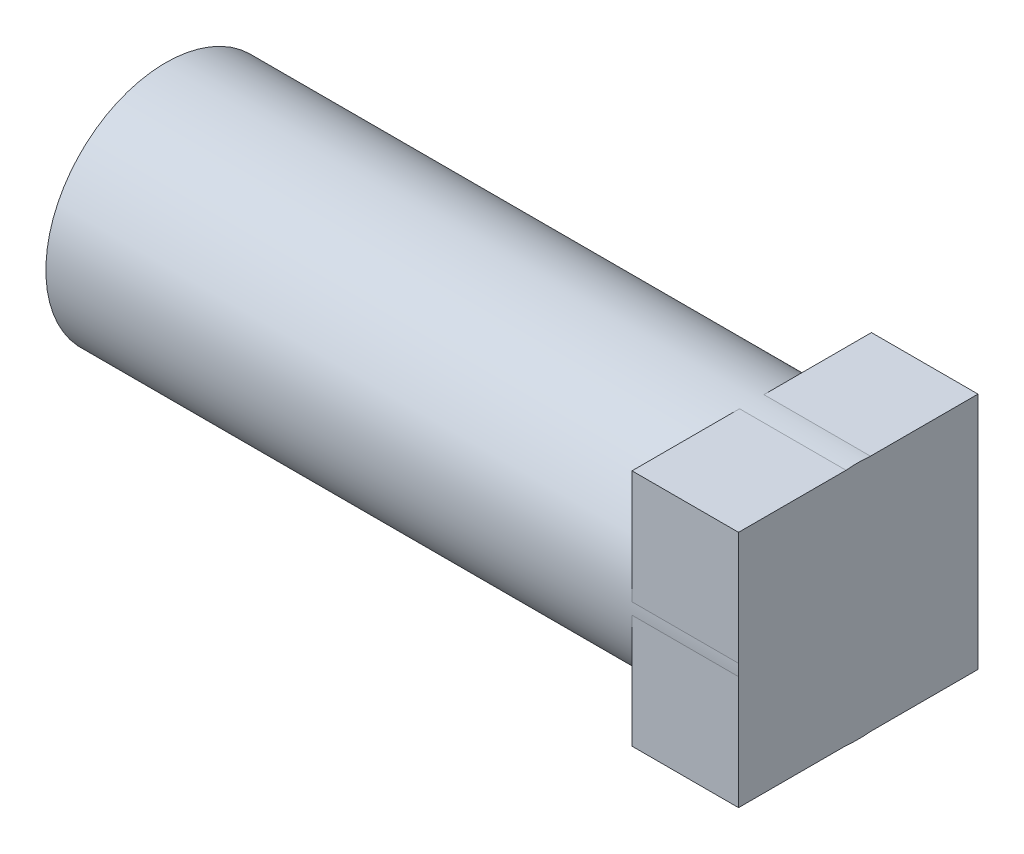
ISO-10303-21;
HEADER;
FILE_DESCRIPTION(('STEP AP214'),'2;1');
FILE_NAME('part.step','',(''),(''),'','','');
FILE_SCHEMA(('AUTOMOTIVE_DESIGN { 1 0 10303 214 1 1 1 1 }'));
ENDSEC;
DATA;
#1=APPLICATION_CONTEXT('core data for automotive mechanical design processes');
#2=APPLICATION_PROTOCOL_DEFINITION('international standard','automotive_design',2000,#1);
#3=PRODUCT_CONTEXT('',#1,'mechanical');
#4=PRODUCT('Part','Part','',(#3));
#5=PRODUCT_RELATED_PRODUCT_CATEGORY('part','',(#4));
#6=PRODUCT_DEFINITION_FORMATION('','',#4);
#7=PRODUCT_DEFINITION_CONTEXT('part definition',#1,'design');
#8=PRODUCT_DEFINITION('design','',#6,#7);
#9=PRODUCT_DEFINITION_SHAPE('','',#8);
#10=(LENGTH_UNIT() NAMED_UNIT(*) SI_UNIT(.MILLI.,.METRE.));
#11=(NAMED_UNIT(*) PLANE_ANGLE_UNIT() SI_UNIT($,.RADIAN.));
#12=(NAMED_UNIT(*) SI_UNIT($,.STERADIAN.) SOLID_ANGLE_UNIT());
#13=UNCERTAINTY_MEASURE_WITH_UNIT(LENGTH_MEASURE(1.E-05),#10,'distance_accuracy_value','');
#14=(GEOMETRIC_REPRESENTATION_CONTEXT(3) GLOBAL_UNCERTAINTY_ASSIGNED_CONTEXT((#13)) GLOBAL_UNIT_ASSIGNED_CONTEXT((#10,
#11,#12)) REPRESENTATION_CONTEXT('',''));
#15=CARTESIAN_POINT('',(0.,0.,0.));
#16=DIRECTION('',(0.,0.,1.));
#17=DIRECTION('',(1.,0.,0.));
#18=AXIS2_PLACEMENT_3D('',#15,#16,#17);
#19=CARTESIAN_POINT('',(13.,0.,0.));
#20=DIRECTION('',(-1.,0.,0.));
#21=DIRECTION('',(0.,0.,1.));
#22=AXIS2_PLACEMENT_3D('',#19,#20,#21);
#23=CYLINDRICAL_SURFACE('',#22,2.25);
#24=CARTESIAN_POINT('',(13.,0.,0.));
#25=DIRECTION('',(1.,0.,0.));
#26=DIRECTION('',(0.,0.,-1.));
#27=AXIS2_PLACEMENT_3D('',#24,#25,#26);
#28=CIRCLE('',#27,2.25);
#29=CARTESIAN_POINT('',(13.,2.2382876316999,-0.229278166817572));
#30=VERTEX_POINT('',#29);
#31=CARTESIAN_POINT('',(13.,2.2382876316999,0.229278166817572));
#32=VERTEX_POINT('',#31);
#33=EDGE_CURVE('E172',#30,#32,#28,.T.);
#34=ORIENTED_EDGE('',*,*,#33,.F.);
#35=DIRECTION('',(-1.,0.,0.));
#36=VECTOR('',#35,1.);
#37=CARTESIAN_POINT('',(13.,2.2382876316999,-0.229278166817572));
#38=LINE('',#37,#36);
#39=CARTESIAN_POINT('',(11.,2.2382876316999,-0.229278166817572));
#40=VERTEX_POINT('',#39);
#41=EDGE_CURVE('E224',#30,#40,#38,.T.);
#42=ORIENTED_EDGE('',*,*,#41,.T.);
#43=CARTESIAN_POINT('',(11.,0.,0.));
#44=DIRECTION('',(1.,0.,0.));
#45=DIRECTION('',(0.,0.,-1.));
#46=AXIS2_PLACEMENT_3D('',#43,#44,#45);
#47=CIRCLE('',#46,2.25);
#48=CARTESIAN_POINT('',(11.,0.108468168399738,-2.2473839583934));
#49=VERTEX_POINT('',#48);
#50=EDGE_CURVE('E11',#49,#40,#47,.T.);
#51=ORIENTED_EDGE('',*,*,#50,.F.);
#52=DIRECTION('',(-1.,0.,0.));
#53=VECTOR('',#52,1.);
#54=CARTESIAN_POINT('',(13.,0.108468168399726,-2.2473839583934));
#55=LINE('',#54,#53);
#56=CARTESIAN_POINT('',(13.,0.108468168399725,-2.2473839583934));
#57=VERTEX_POINT('',#56);
#58=EDGE_CURVE('E232',#49,#57,#55,.F.);
#59=ORIENTED_EDGE('',*,*,#58,.T.);
#60=CARTESIAN_POINT('',(13.,-0.108468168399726,-2.2473839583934));
#61=DIRECTION('',(0.,1.,0.));
#62=VECTOR('',#61,1.);
#63=LINE('',#60,#62);
#64=CARTESIAN_POINT('',(13.,-0.108468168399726,-2.2473839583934));
#65=VERTEX_POINT('',#64);
#66=EDGE_CURVE('E180',#65,#57,#63,.T.);
#67=ORIENTED_EDGE('',*,*,#66,.F.);
#68=DIRECTION('',(-1.,0.,0.));
#69=VECTOR('',#68,1.);
#70=CARTESIAN_POINT('',(13.,-0.108468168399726,-2.2473839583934));
#71=LINE('',#70,#69);
#72=CARTESIAN_POINT('',(11.,-0.108468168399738,-2.2473839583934));
#73=VERTEX_POINT('',#72);
#74=EDGE_CURVE('E228',#65,#73,#71,.T.);
#75=ORIENTED_EDGE('',*,*,#74,.T.);
#76=CARTESIAN_POINT('',(11.,-2.23828763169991,-0.229278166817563));
#77=VERTEX_POINT('',#76);
#78=EDGE_CURVE('E45',#77,#73,#47,.T.);
#79=ORIENTED_EDGE('',*,*,#78,.F.);
#80=DIRECTION('',(-1.,0.,0.));
#81=VECTOR('',#80,1.);
#82=CARTESIAN_POINT('',(13.,-2.23828763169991,-0.229278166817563));
#83=LINE('',#82,#81);
#84=CARTESIAN_POINT('',(13.,-2.23828763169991,-0.229278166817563));
#85=VERTEX_POINT('',#84);
#86=EDGE_CURVE('E250',#77,#85,#83,.F.);
#87=ORIENTED_EDGE('',*,*,#86,.T.);
#88=CARTESIAN_POINT('',(13.,-2.23828763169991,0.229278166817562));
#89=VERTEX_POINT('',#88);
#90=EDGE_CURVE('E170',#89,#85,#28,.T.);
#91=ORIENTED_EDGE('',*,*,#90,.F.);
#92=DIRECTION('',(-1.,0.,0.));
#93=VECTOR('',#92,1.);
#94=CARTESIAN_POINT('',(13.,-2.23828763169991,0.229278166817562));
#95=LINE('',#94,#93);
#96=CARTESIAN_POINT('',(11.,-2.23828763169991,0.229278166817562));
#97=VERTEX_POINT('',#96);
#98=EDGE_CURVE('E258',#89,#97,#95,.T.);
#99=ORIENTED_EDGE('',*,*,#98,.T.);
#100=CARTESIAN_POINT('',(11.,-0.108468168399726,2.2473839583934));
#101=VERTEX_POINT('',#100);
#102=EDGE_CURVE('E147',#101,#97,#47,.T.);
#103=ORIENTED_EDGE('',*,*,#102,.F.);
#104=DIRECTION('',(-1.,0.,0.));
#105=VECTOR('',#104,1.);
#106=CARTESIAN_POINT('',(13.,-0.108468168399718,2.2473839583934));
#107=LINE('',#106,#105);
#108=CARTESIAN_POINT('',(13.,-0.108468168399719,2.2473839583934));
#109=VERTEX_POINT('',#108);
#110=EDGE_CURVE('E131',#101,#109,#107,.F.);
#111=ORIENTED_EDGE('',*,*,#110,.T.);
#112=CARTESIAN_POINT('',(13.,0.108468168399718,2.2473839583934));
#113=DIRECTION('',(0.,-1.,0.));
#114=VECTOR('',#113,1.);
#115=LINE('',#112,#114);
#116=CARTESIAN_POINT('',(13.,0.108468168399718,2.2473839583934));
#117=VERTEX_POINT('',#116);
#118=EDGE_CURVE('E177',#117,#109,#115,.T.);
#119=ORIENTED_EDGE('',*,*,#118,.F.);
#120=DIRECTION('',(-1.,0.,0.));
#121=VECTOR('',#120,1.);
#122=CARTESIAN_POINT('',(13.,0.108468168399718,2.2473839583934));
#123=LINE('',#122,#121);
#124=CARTESIAN_POINT('',(11.,0.108468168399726,2.2473839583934));
#125=VERTEX_POINT('',#124);
#126=EDGE_CURVE('E175',#117,#125,#123,.T.);
#127=ORIENTED_EDGE('',*,*,#126,.T.);
#128=CARTESIAN_POINT('',(11.,2.2382876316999,0.229278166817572));
#129=VERTEX_POINT('',#128);
#130=EDGE_CURVE('E43',#129,#125,#47,.T.);
#131=ORIENTED_EDGE('',*,*,#130,.F.);
#132=DIRECTION('',(-1.,0.,0.));
#133=VECTOR('',#132,1.);
#134=CARTESIAN_POINT('',(13.,2.2382876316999,0.229278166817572));
#135=LINE('',#134,#133);
#136=EDGE_CURVE('E225',#129,#32,#135,.F.);
#137=ORIENTED_EDGE('',*,*,#136,.T.);
#138=EDGE_LOOP('',(#34,#42,#51,#59,#67,#75,#79,#87,#91,#99,#103,#111,#119,#127,#131,#137));
#139=FACE_BOUND('',#138,.T.);
#140=CARTESIAN_POINT('',(0.,0.,0.));
#141=DIRECTION('',(1.,0.,0.));
#142=DIRECTION('',(0.,0.,-1.));
#143=AXIS2_PLACEMENT_3D('',#140,#141,#142);
#144=CIRCLE('',#143,2.25);
#145=CARTESIAN_POINT('',(0.,0.,-2.25));
#146=VERTEX_POINT('',#145);
#147=EDGE_CURVE('E173',#146,#146,#144,.T.);
#148=ORIENTED_EDGE('',*,*,#147,.T.);
#149=EDGE_LOOP('',(#148));
#150=FACE_BOUND('',#149,.T.);
#151=ADVANCED_FACE('F33',(#139,#150),#23,.T.);
#152=CARTESIAN_POINT('',(13.,0.,0.));
#153=DIRECTION('',(1.,0.,0.));
#154=DIRECTION('',(0.,0.,-1.));
#155=AXIS2_PLACEMENT_3D('',#152,#153,#154);
#156=PLANE('',#155);
#157=ORIENTED_EDGE('',*,*,#90,.T.);
#158=DIRECTION('',(0.,0.,-1.));
#159=VECTOR('',#158,1.);
#160=CARTESIAN_POINT('',(13.,-2.2382876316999,-2.2473839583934));
#161=LINE('',#160,#159);
#162=CARTESIAN_POINT('',(13.,-2.2382876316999,-2.2473839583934));
#163=VERTEX_POINT('',#162);
#164=EDGE_CURVE('E396',#85,#163,#161,.T.);
#165=ORIENTED_EDGE('',*,*,#164,.T.);
#166=DIRECTION('',(0.,1.,0.));
#167=VECTOR('',#166,1.);
#168=CARTESIAN_POINT('',(13.,-2.2382876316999,-2.2473839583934));
#169=LINE('',#168,#167);
#170=EDGE_CURVE('E52',#163,#65,#169,.T.);
#171=ORIENTED_EDGE('',*,*,#170,.T.);
#172=ORIENTED_EDGE('',*,*,#66,.T.);
#173=CARTESIAN_POINT('',(13.,2.2382876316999,-2.2473839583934));
#174=VERTEX_POINT('',#173);
#175=EDGE_CURVE('E242',#57,#174,#169,.T.);
#176=ORIENTED_EDGE('',*,*,#175,.T.);
#177=DIRECTION('',(0.,0.,1.));
#178=VECTOR('',#177,1.);
#179=CARTESIAN_POINT('',(13.,2.2382876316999,-2.2473839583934));
#180=LINE('',#179,#178);
#181=EDGE_CURVE('E136',#174,#30,#180,.T.);
#182=ORIENTED_EDGE('',*,*,#181,.T.);
#183=ORIENTED_EDGE('',*,*,#33,.T.);
#184=CARTESIAN_POINT('',(13.,2.2382876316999,2.2473839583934));
#185=VERTEX_POINT('',#184);
#186=EDGE_CURVE('E217',#32,#185,#180,.T.);
#187=ORIENTED_EDGE('',*,*,#186,.T.);
#188=DIRECTION('',(0.,-1.,0.));
#189=VECTOR('',#188,1.);
#190=CARTESIAN_POINT('',(13.,-2.23828763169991,2.2473839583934));
#191=LINE('',#190,#189);
#192=EDGE_CURVE('E163',#185,#117,#191,.T.);
#193=ORIENTED_EDGE('',*,*,#192,.T.);
#194=ORIENTED_EDGE('',*,*,#118,.T.);
#195=CARTESIAN_POINT('',(13.,-2.23828763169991,2.2473839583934));
#196=VERTEX_POINT('',#195);
#197=EDGE_CURVE('E167',#109,#196,#191,.T.);
#198=ORIENTED_EDGE('',*,*,#197,.T.);
#199=EDGE_CURVE('E59',#196,#89,#161,.T.);
#200=ORIENTED_EDGE('',*,*,#199,.T.);
#201=EDGE_LOOP('',(#157,#165,#171,#172,#176,#182,#183,#187,#193,#194,#198,#200));
#202=FACE_BOUND('',#201,.T.);
#203=ADVANCED_FACE('F186',(#202),#156,.T.);
#204=CARTESIAN_POINT('',(0.,0.,0.));
#205=DIRECTION('',(1.,0.,0.));
#206=DIRECTION('',(0.,0.,-1.));
#207=AXIS2_PLACEMENT_3D('',#204,#205,#206);
#208=PLANE('',#207);
#209=ORIENTED_EDGE('',*,*,#147,.F.);
#210=EDGE_LOOP('',(#209));
#211=FACE_BOUND('',#210,.T.);
#212=ADVANCED_FACE('F195',(#211),#208,.F.);
#213=CARTESIAN_POINT('',(11.,0.,0.));
#214=DIRECTION('',(1.,0.,0.));
#215=DIRECTION('',(0.,0.,-1.));
#216=AXIS2_PLACEMENT_3D('',#213,#214,#215);
#217=PLANE('',#216);
#218=DIRECTION('',(0.,0.,-1.));
#219=VECTOR('',#218,1.);
#220=CARTESIAN_POINT('',(11.,-2.2382876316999,-2.2473839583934));
#221=LINE('',#220,#219);
#222=CARTESIAN_POINT('',(11.,-2.2382876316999,-2.2473839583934));
#223=VERTEX_POINT('',#222);
#224=EDGE_CURVE('E149',#77,#223,#221,.T.);
#225=ORIENTED_EDGE('',*,*,#224,.F.);
#226=ORIENTED_EDGE('',*,*,#78,.T.);
#227=DIRECTION('',(0.,1.,0.));
#228=VECTOR('',#227,1.);
#229=CARTESIAN_POINT('',(11.,-2.2382876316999,-2.2473839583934));
#230=LINE('',#229,#228);
#231=EDGE_CURVE('E151',#223,#73,#230,.T.);
#232=ORIENTED_EDGE('',*,*,#231,.F.);
#233=EDGE_LOOP('',(#225,#226,#232));
#234=FACE_BOUND('',#233,.T.);
#235=ADVANCED_FACE('F282',(#234),#217,.F.);
#236=CARTESIAN_POINT('',(11.,-2.2382876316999,-2.2473839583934));
#237=DIRECTION('',(0.,-1.,0.));
#238=DIRECTION('',(0.,0.,-1.));
#239=AXIS2_PLACEMENT_3D('',#236,#237,#238);
#240=PLANE('',#239);
#241=ORIENTED_EDGE('',*,*,#86,.F.);
#242=ORIENTED_EDGE('',*,*,#224,.T.);
#243=DIRECTION('',(1.,0.,0.));
#244=VECTOR('',#243,1.);
#245=CARTESIAN_POINT('',(11.,-2.2382876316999,-2.2473839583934));
#246=LINE('',#245,#244);
#247=EDGE_CURVE('E143',#223,#163,#246,.T.);
#248=ORIENTED_EDGE('',*,*,#247,.T.);
#249=ORIENTED_EDGE('',*,*,#164,.F.);
#250=EDGE_LOOP('',(#241,#242,#248,#249));
#251=FACE_BOUND('',#250,.T.);
#252=ADVANCED_FACE('F303',(#251),#240,.T.);
#253=CARTESIAN_POINT('',(11.,-2.2382876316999,-2.2473839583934));
#254=DIRECTION('',(0.,0.,-1.));
#255=DIRECTION('',(-1.,0.,0.));
#256=AXIS2_PLACEMENT_3D('',#253,#254,#255);
#257=PLANE('',#256);
#258=ORIENTED_EDGE('',*,*,#74,.F.);
#259=ORIENTED_EDGE('',*,*,#170,.F.);
#260=ORIENTED_EDGE('',*,*,#247,.F.);
#261=ORIENTED_EDGE('',*,*,#231,.T.);
#262=EDGE_LOOP('',(#258,#259,#260,#261));
#263=FACE_BOUND('',#262,.T.);
#264=ADVANCED_FACE('F279',(#263),#257,.T.);
#265=DIRECTION('',(0.,-1.,0.));
#266=VECTOR('',#265,1.);
#267=CARTESIAN_POINT('',(11.,-2.23828763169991,2.2473839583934));
#268=LINE('',#267,#266);
#269=CARTESIAN_POINT('',(11.,-2.23828763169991,2.2473839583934));
#270=VERTEX_POINT('',#269);
#271=EDGE_CURVE('E126',#101,#270,#268,.T.);
#272=ORIENTED_EDGE('',*,*,#271,.F.);
#273=ORIENTED_EDGE('',*,*,#102,.T.);
#274=EDGE_CURVE('E141',#270,#97,#221,.T.);
#275=ORIENTED_EDGE('',*,*,#274,.F.);
#276=EDGE_LOOP('',(#272,#273,#275));
#277=FACE_BOUND('',#276,.T.);
#278=ADVANCED_FACE('F146',(#277),#217,.F.);
#279=ORIENTED_EDGE('',*,*,#98,.F.);
#280=ORIENTED_EDGE('',*,*,#199,.F.);
#281=DIRECTION('',(1.,0.,0.));
#282=VECTOR('',#281,1.);
#283=CARTESIAN_POINT('',(11.,-2.23828763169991,2.2473839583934));
#284=LINE('',#283,#282);
#285=EDGE_CURVE('E129',#270,#196,#284,.T.);
#286=ORIENTED_EDGE('',*,*,#285,.F.);
#287=ORIENTED_EDGE('',*,*,#274,.T.);
#288=EDGE_LOOP('',(#279,#280,#286,#287));
#289=FACE_BOUND('',#288,.T.);
#290=ADVANCED_FACE('F140',(#289),#240,.T.);
#291=CARTESIAN_POINT('',(11.,-2.23828763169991,2.2473839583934));
#292=DIRECTION('',(0.,0.,1.));
#293=DIRECTION('',(1.,0.,0.));
#294=AXIS2_PLACEMENT_3D('',#291,#292,#293);
#295=PLANE('',#294);
#296=ORIENTED_EDGE('',*,*,#110,.F.);
#297=ORIENTED_EDGE('',*,*,#271,.T.);
#298=ORIENTED_EDGE('',*,*,#285,.T.);
#299=ORIENTED_EDGE('',*,*,#197,.F.);
#300=EDGE_LOOP('',(#296,#297,#298,#299));
#301=FACE_BOUND('',#300,.T.);
#302=ADVANCED_FACE('F128',(#301),#295,.T.);
#303=CARTESIAN_POINT('',(11.,2.2382876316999,-2.2473839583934));
#304=DIRECTION('',(0.,1.,0.));
#305=DIRECTION('',(0.,0.,1.));
#306=AXIS2_PLACEMENT_3D('',#303,#304,#305);
#307=PLANE('',#306);
#308=ORIENTED_EDGE('',*,*,#136,.F.);
#309=DIRECTION('',(0.,0.,1.));
#310=VECTOR('',#309,1.);
#311=CARTESIAN_POINT('',(11.,2.2382876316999,-2.2473839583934));
#312=LINE('',#311,#310);
#313=CARTESIAN_POINT('',(11.,2.2382876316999,2.2473839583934));
#314=VERTEX_POINT('',#313);
#315=EDGE_CURVE('E155',#129,#314,#312,.T.);
#316=ORIENTED_EDGE('',*,*,#315,.T.);
#317=DIRECTION('',(1.,0.,0.));
#318=VECTOR('',#317,1.);
#319=CARTESIAN_POINT('',(11.,2.2382876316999,2.2473839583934));
#320=LINE('',#319,#318);
#321=EDGE_CURVE('E248',#314,#185,#320,.T.);
#322=ORIENTED_EDGE('',*,*,#321,.T.);
#323=ORIENTED_EDGE('',*,*,#186,.F.);
#324=EDGE_LOOP('',(#308,#316,#322,#323));
#325=FACE_BOUND('',#324,.T.);
#326=ADVANCED_FACE('F273',(#325),#307,.T.);
#327=ORIENTED_EDGE('',*,*,#126,.F.);
#328=ORIENTED_EDGE('',*,*,#192,.F.);
#329=ORIENTED_EDGE('',*,*,#321,.F.);
#330=EDGE_CURVE('E135',#314,#125,#268,.T.);
#331=ORIENTED_EDGE('',*,*,#330,.T.);
#332=EDGE_LOOP('',(#327,#328,#329,#331));
#333=FACE_BOUND('',#332,.T.);
#334=ADVANCED_FACE('F196',(#333),#295,.T.);
#335=ORIENTED_EDGE('',*,*,#315,.F.);
#336=ORIENTED_EDGE('',*,*,#130,.T.);
#337=ORIENTED_EDGE('',*,*,#330,.F.);
#338=EDGE_LOOP('',(#335,#336,#337));
#339=FACE_BOUND('',#338,.T.);
#340=ADVANCED_FACE('F280',(#339),#217,.F.);
#341=CARTESIAN_POINT('',(11.,2.2382876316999,-2.2473839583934));
#342=VERTEX_POINT('',#341);
#343=EDGE_CURVE('E148',#49,#342,#230,.T.);
#344=ORIENTED_EDGE('',*,*,#343,.F.);
#345=ORIENTED_EDGE('',*,*,#50,.T.);
#346=EDGE_CURVE('E144',#342,#40,#312,.T.);
#347=ORIENTED_EDGE('',*,*,#346,.F.);
#348=EDGE_LOOP('',(#344,#345,#347));
#349=FACE_BOUND('',#348,.T.);
#350=ADVANCED_FACE('F268',(#349),#217,.F.);
#351=ORIENTED_EDGE('',*,*,#41,.F.);
#352=ORIENTED_EDGE('',*,*,#181,.F.);
#353=DIRECTION('',(1.,0.,0.));
#354=VECTOR('',#353,1.);
#355=CARTESIAN_POINT('',(11.,2.2382876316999,-2.2473839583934));
#356=LINE('',#355,#354);
#357=EDGE_CURVE('E251',#342,#174,#356,.T.);
#358=ORIENTED_EDGE('',*,*,#357,.F.);
#359=ORIENTED_EDGE('',*,*,#346,.T.);
#360=EDGE_LOOP('',(#351,#352,#358,#359));
#361=FACE_BOUND('',#360,.T.);
#362=ADVANCED_FACE('F270',(#361),#307,.T.);
#363=ORIENTED_EDGE('',*,*,#58,.F.);
#364=ORIENTED_EDGE('',*,*,#343,.T.);
#365=ORIENTED_EDGE('',*,*,#357,.T.);
#366=ORIENTED_EDGE('',*,*,#175,.F.);
#367=EDGE_LOOP('',(#363,#364,#365,#366));
#368=FACE_BOUND('',#367,.T.);
#369=ADVANCED_FACE('F264',(#368),#257,.T.);
#370=CLOSED_SHELL('',(#151,#203,#212,#235,#252,#264,#278,#290,#302,#326,#334,#340,#350,#362,#369));
#371=MANIFOLD_SOLID_BREP('B2',#370);
#372=ADVANCED_BREP_SHAPE_REPRESENTATION('',(#18,#371),#14);
#373=SHAPE_DEFINITION_REPRESENTATION(#9,#372);
ENDSEC;
END-ISO-10303-21;
